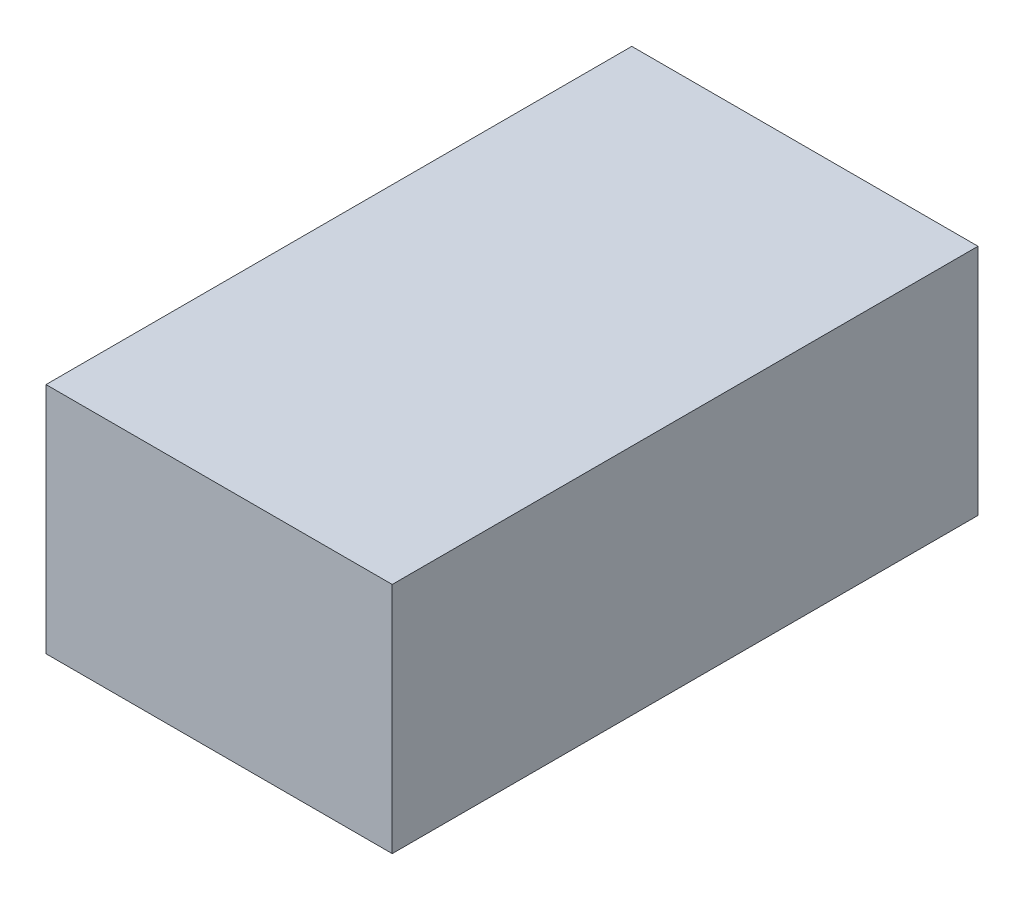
ISO-10303-21;
HEADER;
FILE_DESCRIPTION(('STEP AP214'),'2;1');
FILE_NAME('part.step','',(''),(''),'','','');
FILE_SCHEMA(('AUTOMOTIVE_DESIGN { 1 0 10303 214 1 1 1 1 }'));
ENDSEC;
DATA;
#1=APPLICATION_CONTEXT('core data for automotive mechanical design processes');
#2=APPLICATION_PROTOCOL_DEFINITION('international standard','automotive_design',2000,#1);
#3=PRODUCT_CONTEXT('',#1,'mechanical');
#4=PRODUCT('Part','Part','',(#3));
#5=PRODUCT_RELATED_PRODUCT_CATEGORY('part','',(#4));
#6=PRODUCT_DEFINITION_FORMATION('','',#4);
#7=PRODUCT_DEFINITION_CONTEXT('part definition',#1,'design');
#8=PRODUCT_DEFINITION('design','',#6,#7);
#9=PRODUCT_DEFINITION_SHAPE('','',#8);
#10=(LENGTH_UNIT() NAMED_UNIT(*) SI_UNIT(.MILLI.,.METRE.));
#11=(NAMED_UNIT(*) PLANE_ANGLE_UNIT() SI_UNIT($,.RADIAN.));
#12=(NAMED_UNIT(*) SI_UNIT($,.STERADIAN.) SOLID_ANGLE_UNIT());
#13=UNCERTAINTY_MEASURE_WITH_UNIT(LENGTH_MEASURE(1.E-05),#10,'distance_accuracy_value','');
#14=(GEOMETRIC_REPRESENTATION_CONTEXT(3) GLOBAL_UNCERTAINTY_ASSIGNED_CONTEXT((#13)) GLOBAL_UNIT_ASSIGNED_CONTEXT((#10,
#11,#12)) REPRESENTATION_CONTEXT('',''));
#15=CARTESIAN_POINT('',(0.,0.,0.));
#16=DIRECTION('',(0.,0.,1.));
#17=DIRECTION('',(1.,0.,0.));
#18=AXIS2_PLACEMENT_3D('',#15,#16,#17);
#19=CARTESIAN_POINT('',(59.103677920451,39.798686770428,100.));
#20=DIRECTION('',(-1.,0.,0.));
#21=DIRECTION('',(0.,0.,1.));
#22=AXIS2_PLACEMENT_3D('',#19,#20,#21);
#23=PLANE('',#22);
#24=DIRECTION('',(0.,1.,0.));
#25=VECTOR('',#24,1.);
#26=CARTESIAN_POINT('',(59.103677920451,39.798686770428,-100.));
#27=LINE('',#26,#25);
#28=CARTESIAN_POINT('',(59.103677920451,-39.798686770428,-100.));
#29=VERTEX_POINT('',#28);
#30=CARTESIAN_POINT('',(59.103677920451,39.798686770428,-100.));
#31=VERTEX_POINT('',#30);
#32=EDGE_CURVE('E96',#29,#31,#27,.T.);
#33=ORIENTED_EDGE('',*,*,#32,.T.);
#34=DIRECTION('',(0.,0.,-1.));
#35=VECTOR('',#34,1.);
#36=CARTESIAN_POINT('',(59.103677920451,39.798686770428,100.));
#37=LINE('',#36,#35);
#38=CARTESIAN_POINT('',(59.103677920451,39.798686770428,100.));
#39=VERTEX_POINT('',#38);
#40=EDGE_CURVE('E11',#39,#31,#37,.T.);
#41=ORIENTED_EDGE('',*,*,#40,.F.);
#42=DIRECTION('',(0.,1.,0.));
#43=VECTOR('',#42,1.);
#44=CARTESIAN_POINT('',(59.103677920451,39.798686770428,100.));
#45=LINE('',#44,#43);
#46=CARTESIAN_POINT('',(59.103677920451,-39.798686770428,100.));
#47=VERTEX_POINT('',#46);
#48=EDGE_CURVE('E84',#47,#39,#45,.T.);
#49=ORIENTED_EDGE('',*,*,#48,.F.);
#50=DIRECTION('',(0.,0.,-1.));
#51=VECTOR('',#50,1.);
#52=CARTESIAN_POINT('',(59.103677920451,-39.798686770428,100.));
#53=LINE('',#52,#51);
#54=EDGE_CURVE('E92',#47,#29,#53,.T.);
#55=ORIENTED_EDGE('',*,*,#54,.T.);
#56=EDGE_LOOP('',(#33,#41,#49,#55));
#57=FACE_BOUND('',#56,.T.);
#58=ADVANCED_FACE('F33',(#57),#23,.F.);
#59=CARTESIAN_POINT('',(-59.103677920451,39.798686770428,100.));
#60=DIRECTION('',(0.,-1.,0.));
#61=DIRECTION('',(0.,0.,-1.));
#62=AXIS2_PLACEMENT_3D('',#59,#60,#61);
#63=PLANE('',#62);
#64=DIRECTION('',(-1.,0.,0.));
#65=VECTOR('',#64,1.);
#66=CARTESIAN_POINT('',(-59.103677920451,39.798686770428,-100.));
#67=LINE('',#66,#65);
#68=CARTESIAN_POINT('',(-59.103677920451,39.798686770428,-100.));
#69=VERTEX_POINT('',#68);
#70=EDGE_CURVE('E88',#31,#69,#67,.T.);
#71=ORIENTED_EDGE('',*,*,#70,.T.);
#72=DIRECTION('',(0.,0.,-1.));
#73=VECTOR('',#72,1.);
#74=CARTESIAN_POINT('',(-59.103677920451,39.798686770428,100.));
#75=LINE('',#74,#73);
#76=CARTESIAN_POINT('',(-59.103677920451,39.798686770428,100.));
#77=VERTEX_POINT('',#76);
#78=EDGE_CURVE('E41',#77,#69,#75,.T.);
#79=ORIENTED_EDGE('',*,*,#78,.F.);
#80=DIRECTION('',(-1.,0.,0.));
#81=VECTOR('',#80,1.);
#82=CARTESIAN_POINT('',(-59.103677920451,39.798686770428,100.));
#83=LINE('',#82,#81);
#84=EDGE_CURVE('E79',#39,#77,#83,.T.);
#85=ORIENTED_EDGE('',*,*,#84,.F.);
#86=ORIENTED_EDGE('',*,*,#40,.T.);
#87=EDGE_LOOP('',(#71,#79,#85,#86));
#88=FACE_BOUND('',#87,.T.);
#89=ADVANCED_FACE('F87',(#88),#63,.F.);
#90=CARTESIAN_POINT('',(-59.103677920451,39.798686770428,100.));
#91=DIRECTION('',(1.,0.,0.));
#92=DIRECTION('',(0.,0.,-1.));
#93=AXIS2_PLACEMENT_3D('',#90,#91,#92);
#94=PLANE('',#93);
#95=DIRECTION('',(0.,-1.,0.));
#96=VECTOR('',#95,1.);
#97=CARTESIAN_POINT('',(-59.103677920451,39.798686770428,-100.));
#98=LINE('',#97,#96);
#99=CARTESIAN_POINT('',(-59.103677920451,-39.798686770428,-100.));
#100=VERTEX_POINT('',#99);
#101=EDGE_CURVE('E66',#69,#100,#98,.T.);
#102=ORIENTED_EDGE('',*,*,#101,.T.);
#103=DIRECTION('',(0.,0.,-1.));
#104=VECTOR('',#103,1.);
#105=CARTESIAN_POINT('',(-59.103677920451,-39.798686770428,100.));
#106=LINE('',#105,#104);
#107=CARTESIAN_POINT('',(-59.103677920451,-39.798686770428,100.));
#108=VERTEX_POINT('',#107);
#109=EDGE_CURVE('E89',#108,#100,#106,.T.);
#110=ORIENTED_EDGE('',*,*,#109,.F.);
#111=DIRECTION('',(0.,-1.,0.));
#112=VECTOR('',#111,1.);
#113=CARTESIAN_POINT('',(-59.103677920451,39.798686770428,100.));
#114=LINE('',#113,#112);
#115=EDGE_CURVE('E82',#77,#108,#114,.T.);
#116=ORIENTED_EDGE('',*,*,#115,.F.);
#117=ORIENTED_EDGE('',*,*,#78,.T.);
#118=EDGE_LOOP('',(#102,#110,#116,#117));
#119=FACE_BOUND('',#118,.T.);
#120=ADVANCED_FACE('F90',(#119),#94,.F.);
#121=CARTESIAN_POINT('',(-59.103677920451,-39.798686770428,100.));
#122=DIRECTION('',(0.,1.,0.));
#123=DIRECTION('',(0.,0.,1.));
#124=AXIS2_PLACEMENT_3D('',#121,#122,#123);
#125=PLANE('',#124);
#126=DIRECTION('',(1.,0.,0.));
#127=VECTOR('',#126,1.);
#128=CARTESIAN_POINT('',(-59.103677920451,-39.798686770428,-100.));
#129=LINE('',#128,#127);
#130=EDGE_CURVE('E72',#100,#29,#129,.T.);
#131=ORIENTED_EDGE('',*,*,#130,.T.);
#132=ORIENTED_EDGE('',*,*,#54,.F.);
#133=DIRECTION('',(1.,0.,0.));
#134=VECTOR('',#133,1.);
#135=CARTESIAN_POINT('',(-59.103677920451,-39.798686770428,100.));
#136=LINE('',#135,#134);
#137=EDGE_CURVE('E49',#108,#47,#136,.T.);
#138=ORIENTED_EDGE('',*,*,#137,.F.);
#139=ORIENTED_EDGE('',*,*,#109,.T.);
#140=EDGE_LOOP('',(#131,#132,#138,#139));
#141=FACE_BOUND('',#140,.T.);
#142=ADVANCED_FACE('F103',(#141),#125,.F.);
#143=CARTESIAN_POINT('',(59.103677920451,-39.798686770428,100.));
#144=DIRECTION('',(0.,0.,1.));
#145=DIRECTION('',(1.,0.,0.));
#146=AXIS2_PLACEMENT_3D('',#143,#144,#145);
#147=PLANE('',#146);
#148=ORIENTED_EDGE('',*,*,#48,.T.);
#149=ORIENTED_EDGE('',*,*,#84,.T.);
#150=ORIENTED_EDGE('',*,*,#115,.T.);
#151=ORIENTED_EDGE('',*,*,#137,.T.);
#152=EDGE_LOOP('',(#148,#149,#150,#151));
#153=FACE_BOUND('',#152,.T.);
#154=ADVANCED_FACE('F80',(#153),#147,.T.);
#155=CARTESIAN_POINT('',(59.103677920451,-39.798686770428,-100.));
#156=DIRECTION('',(0.,0.,1.));
#157=DIRECTION('',(1.,0.,0.));
#158=AXIS2_PLACEMENT_3D('',#155,#156,#157);
#159=PLANE('',#158);
#160=ORIENTED_EDGE('',*,*,#32,.F.);
#161=ORIENTED_EDGE('',*,*,#130,.F.);
#162=ORIENTED_EDGE('',*,*,#101,.F.);
#163=ORIENTED_EDGE('',*,*,#70,.F.);
#164=EDGE_LOOP('',(#160,#161,#162,#163));
#165=FACE_BOUND('',#164,.T.);
#166=ADVANCED_FACE('F106',(#165),#159,.F.);
#167=CLOSED_SHELL('',(#58,#89,#120,#142,#154,#166));
#168=MANIFOLD_SOLID_BREP('B2',#167);
#169=ADVANCED_BREP_SHAPE_REPRESENTATION('',(#18,#168),#14);
#170=SHAPE_DEFINITION_REPRESENTATION(#9,#169);
ENDSEC;
END-ISO-10303-21;
